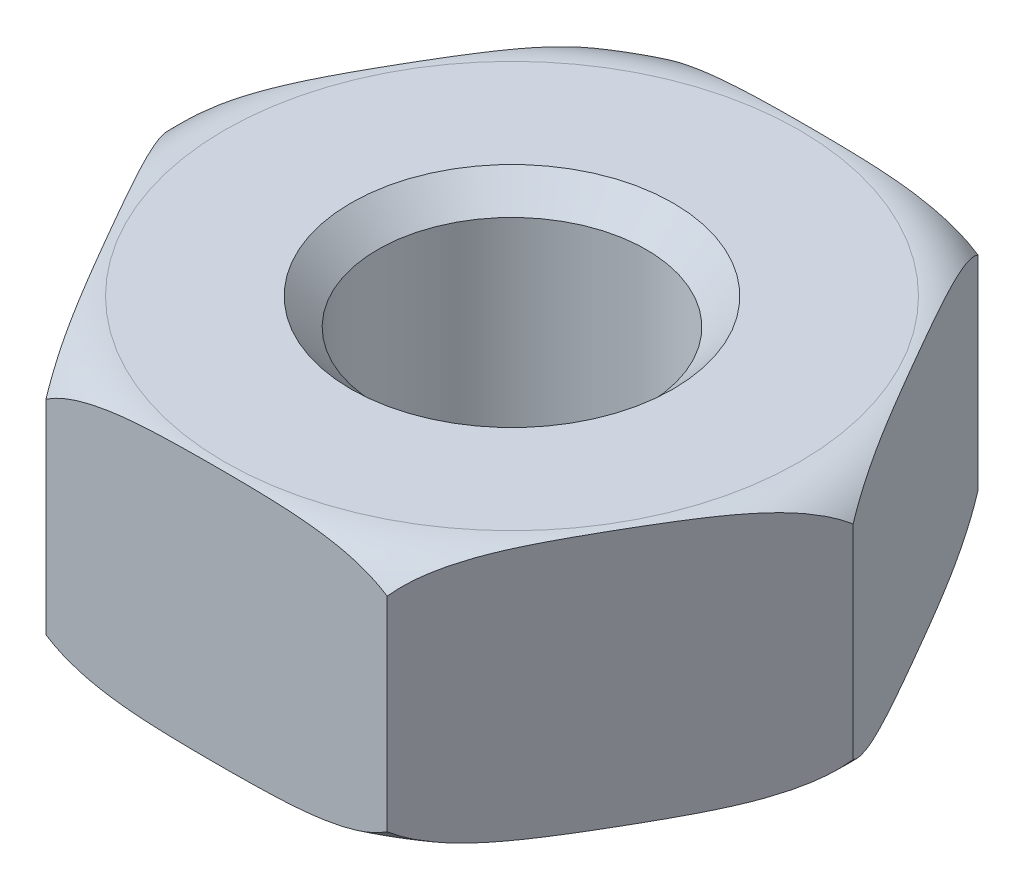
from build123d import *

# Parameters (mm, degrees)
BOSS_EXTRU_1_DEPTH = 2.4
TROU_TARAUD_M31_D  = 2.5
CHANFREIN2_SIZE    = 0.25


with BuildPart() as part:
    # Esquisse1 → Boss.-Extru.1 (new body)
    with BuildSketch(Plane(origin=(0, 0, 0), x_dir=(1, 0, 0), z_dir=(0, 1, 0))):
        Polygon((1.58771324, -2.75), (3.175426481, 0), (1.58771324, 2.75), (-1.58771324, 2.75), (-3.175426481, 0), (-1.58771324, -2.75), align=None)
    extrude(amount=BOSS_EXTRU_1_DEPTH)

    # Esquisse2 → Enl_vement de mati_re-R_volution1 (revolve, cut)
    with BuildSketch(Plane.XY, mode=Mode.PRIVATE) as enl_vement_de_mati_re_r_volution1_sk:
        with BuildLine():
            Line((-3.175426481, 0), (-3.175426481, 0.25))
            ThreePointArc((-3.175426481, 0.25), (-2.954934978, 0.065983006), (-2.675426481, 0))
            Line((-2.675426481, 0), (-3.175426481, 0))
        make_face()
    enl_vement_de_mati_re_r_volution1 = revolve(enl_vement_de_mati_re_r_volution1_sk.sketch.rotate(Axis((0, 0, 0), (0, 1, 0)), 180), axis=Axis((0, 0, 0), (0, 1, 0)), mode=Mode.SUBTRACT)

    # Sym_trie1: Enl_vement de mati_re-R_volution1 across plane
    add(enl_vement_de_mati_re_r_volution1.mirror(Plane.ZX.offset(1.2)), mode=Mode.SUBTRACT)

    # Trou taraud_ M31 (through all)
    with Locations(Plane(origin=(0, 0, 0), x_dir=(0, 0, -1), z_dir=(0, -1, 0))):
        with Locations((0, 0)):
            Hole(TROU_TARAUD_M31_D / 2)

    # Chanfrein2
    chanfrein2_edges = [part.edges().sort_by_distance(p)[0] for p in [
        (0, 0, -1.25),
        (0, 2.4, -1.25),
    ]]
    chamfer(chanfrein2_edges, length=CHANFREIN2_SIZE)


solid = part.part
